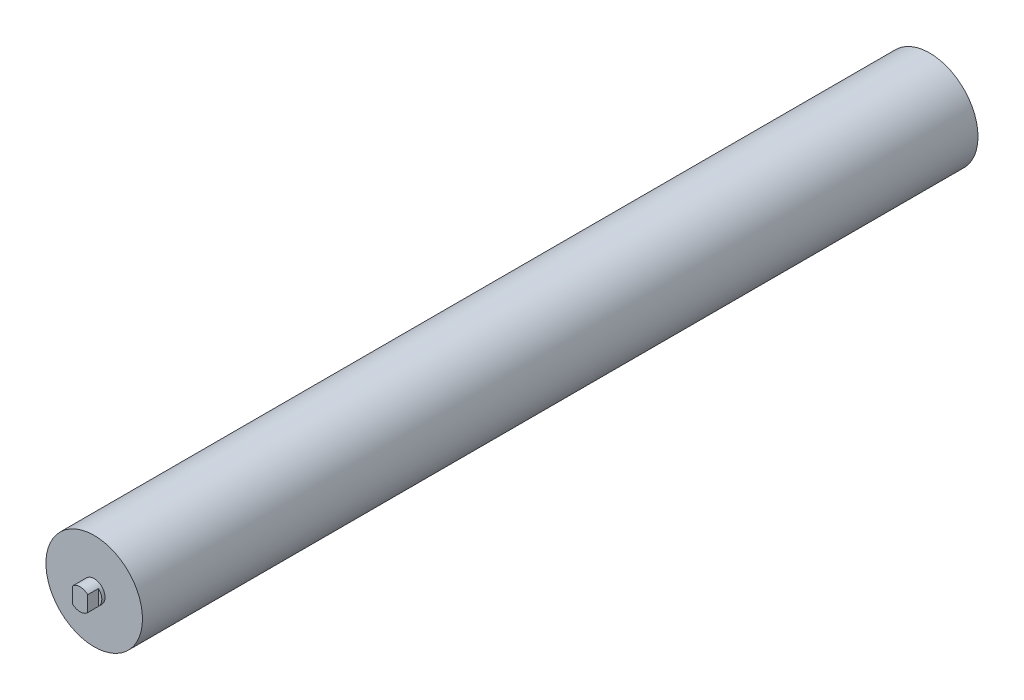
from build123d import *

# Parameters (mm, degrees)
ESQUISSE1_R             = 44.5
BASE_EXTRUSION_DEPTH    = 770
ESQUISSE2_R             = 10
BOSS_EXTRU_1_DEPTH      = 13
BOSS_EXTRU_2_START      = 13
ESQUISSE3_R             = 10
BOSS_EXTRU_2_DEPTH      = 13
ESQUISSE5_OUTSIDE_W     = 252.178
ESQUISSE5_OUTSIDE_H     = 252.178
ESQUISSE5_OUTSIDE_W_2   = 14
ESQUISSE5_OUTSIDE_H_2   = 37.599051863
ENL_V_MAT_EXTRU_1_DEPTH = 10
ESQUISSE6_OUTSIDE_W     = 252.178
ESQUISSE6_OUTSIDE_H     = 252.178
ESQUISSE6_OUTSIDE_W_2   = 14
ESQUISSE6_OUTSIDE_H_2   = 39.851078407
ENL_V_MAT_EXTRU_2_DEPTH = 10


with BuildPart() as part:
    # Esquisse1 → Base-Extrusion (new body)
    with BuildSketch(Plane.XY):
        Circle(ESQUISSE1_R)
    extrude(amount=BASE_EXTRUSION_DEPTH)

    # Esquisse2 → Boss.-Extru.1 (add)
    with BuildSketch(Plane.XY.offset(770)):
        with Locations(Location((0, 0, 0), (0, 0, 180))):
            Circle(ESQUISSE2_R)
    extrude(amount=BOSS_EXTRU_1_DEPTH)

    # Esquisse3 → Boss.-Extru.2 (add)
    with BuildSketch(Plane(origin=(0, 0, 0), x_dir=(-1, 0, 0), z_dir=(0, 0, -1)).offset(BOSS_EXTRU_2_START)):
        Circle(ESQUISSE3_R)
    extrude(amount=-BOSS_EXTRU_2_DEPTH)

    # Esquisse5 outside → Enl_v. mat.-Extru.1 (cut)
    with BuildSketch(Plane(origin=(0, 0, -13), x_dir=(-1, 0, 0), z_dir=(0, 0, -1))):
        Rectangle(ESQUISSE5_OUTSIDE_W, ESQUISSE5_OUTSIDE_H)
        with Locations((0, 1.468712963)):
            Rectangle(ESQUISSE5_OUTSIDE_W_2, ESQUISSE5_OUTSIDE_H_2, mode=Mode.SUBTRACT)
    extrude(amount=-ENL_V_MAT_EXTRU_1_DEPTH, mode=Mode.SUBTRACT)

    # Esquisse6 outside → Enl_v. mat.-Extru.2 (cut)
    with BuildSketch(Plane.XY.offset(783)):
        Rectangle(ESQUISSE6_OUTSIDE_W, ESQUISSE6_OUTSIDE_H)
        with Locations((0, -0.146871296)):
            Rectangle(ESQUISSE6_OUTSIDE_W_2, ESQUISSE6_OUTSIDE_H_2, mode=Mode.SUBTRACT)
    extrude(amount=-ENL_V_MAT_EXTRU_2_DEPTH, mode=Mode.SUBTRACT)


solid = part.part
